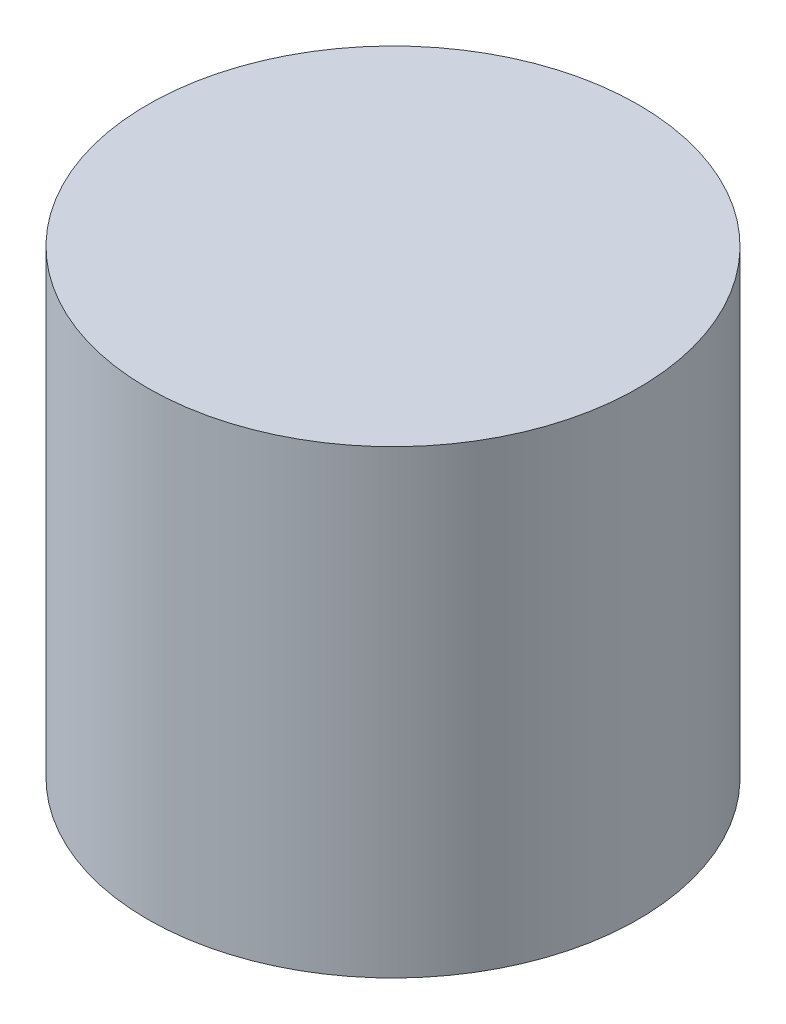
from build123d import *


with BuildPart() as part:
    # Sketch1 → Revolve1 (revolve)
    with BuildSketch(Plane.XY, mode=Mode.PRIVATE) as revolve1_sk:
        Polygon((0, 13), (4, 13), (4, 0), (8, 0), (8, 15), (0, 15), align=None)
    revolve(revolve1_sk.sketch.rotate(Axis((0, 0, 0), (0, 1, 0)), 90), axis=Axis((0, 0, 0), (0, 1, 0)))


solid = part.part
